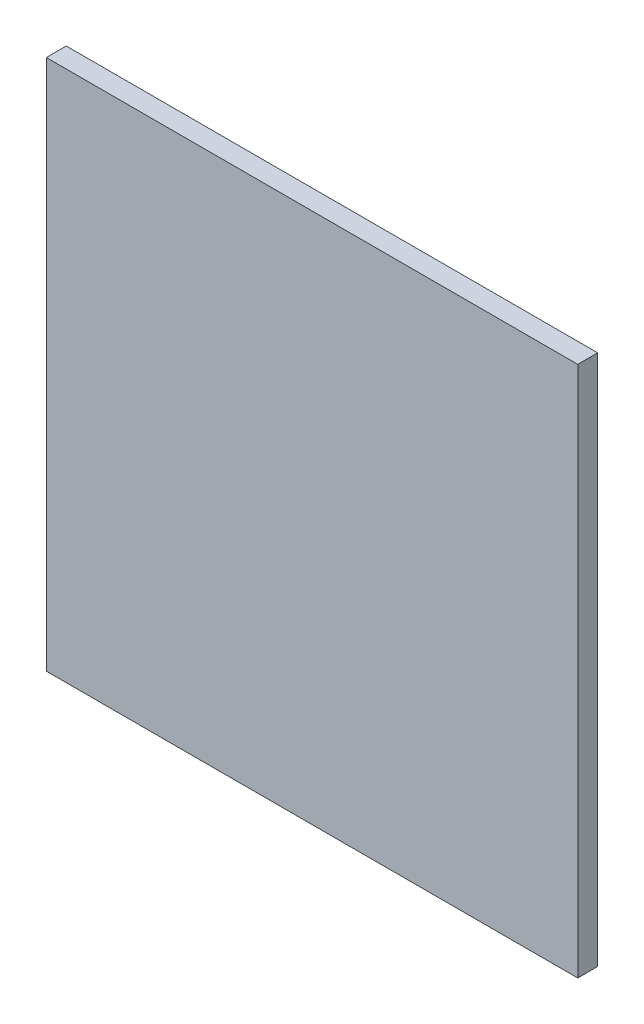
ISO-10303-21;
HEADER;
FILE_DESCRIPTION(('STEP AP214'),'2;1');
FILE_NAME('part.step','',(''),(''),'','','');
FILE_SCHEMA(('AUTOMOTIVE_DESIGN { 1 0 10303 214 1 1 1 1 }'));
ENDSEC;
DATA;
#1=APPLICATION_CONTEXT('core data for automotive mechanical design processes');
#2=APPLICATION_PROTOCOL_DEFINITION('international standard','automotive_design',2000,#1);
#3=PRODUCT_CONTEXT('',#1,'mechanical');
#4=PRODUCT('Part','Part','',(#3));
#5=PRODUCT_RELATED_PRODUCT_CATEGORY('part','',(#4));
#6=PRODUCT_DEFINITION_FORMATION('','',#4);
#7=PRODUCT_DEFINITION_CONTEXT('part definition',#1,'design');
#8=PRODUCT_DEFINITION('design','',#6,#7);
#9=PRODUCT_DEFINITION_SHAPE('','',#8);
#10=(LENGTH_UNIT() NAMED_UNIT(*) SI_UNIT(.MILLI.,.METRE.));
#11=(NAMED_UNIT(*) PLANE_ANGLE_UNIT() SI_UNIT($,.RADIAN.));
#12=(NAMED_UNIT(*) SI_UNIT($,.STERADIAN.) SOLID_ANGLE_UNIT());
#13=UNCERTAINTY_MEASURE_WITH_UNIT(LENGTH_MEASURE(1.E-05),#10,'distance_accuracy_value','');
#14=(GEOMETRIC_REPRESENTATION_CONTEXT(3) GLOBAL_UNCERTAINTY_ASSIGNED_CONTEXT((#13)) GLOBAL_UNIT_ASSIGNED_CONTEXT((#10,
#11,#12)) REPRESENTATION_CONTEXT('',''));
#15=CARTESIAN_POINT('',(0.,0.,0.));
#16=DIRECTION('',(0.,0.,1.));
#17=DIRECTION('',(1.,0.,0.));
#18=AXIS2_PLACEMENT_3D('',#15,#16,#17);
#19=CARTESIAN_POINT('',(200.,200.,15.));
#20=DIRECTION('',(-1.,0.,0.));
#21=DIRECTION('',(0.,-1.,0.));
#22=AXIS2_PLACEMENT_3D('',#19,#20,#21);
#23=PLANE('',#22);
#24=DIRECTION('',(0.,1.,0.));
#25=VECTOR('',#24,1.);
#26=CARTESIAN_POINT('',(200.,200.,0.));
#27=LINE('',#26,#25);
#28=CARTESIAN_POINT('',(200.,-200.,0.));
#29=VERTEX_POINT('',#28);
#30=CARTESIAN_POINT('',(200.,200.,0.));
#31=VERTEX_POINT('',#30);
#32=EDGE_CURVE('E111',#29,#31,#27,.T.);
#33=ORIENTED_EDGE('',*,*,#32,.T.);
#34=DIRECTION('',(0.,0.,-1.));
#35=VECTOR('',#34,1.);
#36=CARTESIAN_POINT('',(200.,200.,15.));
#37=LINE('',#36,#35);
#38=CARTESIAN_POINT('',(200.,200.,15.));
#39=VERTEX_POINT('',#38);
#40=EDGE_CURVE('E11',#39,#31,#37,.T.);
#41=ORIENTED_EDGE('',*,*,#40,.F.);
#42=DIRECTION('',(0.,1.,0.));
#43=VECTOR('',#42,1.);
#44=CARTESIAN_POINT('',(200.,200.,15.));
#45=LINE('',#44,#43);
#46=CARTESIAN_POINT('',(200.,-200.,15.));
#47=VERTEX_POINT('',#46);
#48=EDGE_CURVE('E95',#47,#39,#45,.T.);
#49=ORIENTED_EDGE('',*,*,#48,.F.);
#50=DIRECTION('',(0.,0.,-1.));
#51=VECTOR('',#50,1.);
#52=CARTESIAN_POINT('',(200.,-200.,15.));
#53=LINE('',#52,#51);
#54=EDGE_CURVE('E107',#47,#29,#53,.T.);
#55=ORIENTED_EDGE('',*,*,#54,.T.);
#56=EDGE_LOOP('',(#33,#41,#49,#55));
#57=FACE_BOUND('',#56,.T.);
#58=ADVANCED_FACE('F43',(#57),#23,.F.);
#59=CARTESIAN_POINT('',(-200.,200.,15.));
#60=DIRECTION('',(0.,-1.,0.));
#61=DIRECTION('',(0.,0.,-1.));
#62=AXIS2_PLACEMENT_3D('',#59,#60,#61);
#63=PLANE('',#62);
#64=DIRECTION('',(-1.,0.,0.));
#65=VECTOR('',#64,1.);
#66=CARTESIAN_POINT('',(-200.,200.,0.));
#67=LINE('',#66,#65);
#68=CARTESIAN_POINT('',(-200.,200.,0.));
#69=VERTEX_POINT('',#68);
#70=EDGE_CURVE('E100',#31,#69,#67,.T.);
#71=ORIENTED_EDGE('',*,*,#70,.T.);
#72=DIRECTION('',(0.,0.,-1.));
#73=VECTOR('',#72,1.);
#74=CARTESIAN_POINT('',(-200.,200.,15.));
#75=LINE('',#74,#73);
#76=CARTESIAN_POINT('',(-200.,200.,15.));
#77=VERTEX_POINT('',#76);
#78=EDGE_CURVE('E52',#77,#69,#75,.T.);
#79=ORIENTED_EDGE('',*,*,#78,.F.);
#80=DIRECTION('',(-1.,0.,0.));
#81=VECTOR('',#80,1.);
#82=CARTESIAN_POINT('',(-200.,200.,15.));
#83=LINE('',#82,#81);
#84=EDGE_CURVE('E90',#39,#77,#83,.T.);
#85=ORIENTED_EDGE('',*,*,#84,.F.);
#86=ORIENTED_EDGE('',*,*,#40,.T.);
#87=EDGE_LOOP('',(#71,#79,#85,#86));
#88=FACE_BOUND('',#87,.T.);
#89=ADVANCED_FACE('F99',(#88),#63,.F.);
#90=CARTESIAN_POINT('',(-200.,200.,15.));
#91=DIRECTION('',(1.,0.,0.));
#92=DIRECTION('',(0.,1.,0.));
#93=AXIS2_PLACEMENT_3D('',#90,#91,#92);
#94=PLANE('',#93);
#95=DIRECTION('',(0.,-1.,0.));
#96=VECTOR('',#95,1.);
#97=CARTESIAN_POINT('',(-200.,200.,0.));
#98=LINE('',#97,#96);
#99=CARTESIAN_POINT('',(-200.,-200.,0.));
#100=VERTEX_POINT('',#99);
#101=EDGE_CURVE('E77',#69,#100,#98,.T.);
#102=ORIENTED_EDGE('',*,*,#101,.T.);
#103=DIRECTION('',(0.,0.,-1.));
#104=VECTOR('',#103,1.);
#105=CARTESIAN_POINT('',(-200.,-200.,15.));
#106=LINE('',#105,#104);
#107=CARTESIAN_POINT('',(-200.,-200.,15.));
#108=VERTEX_POINT('',#107);
#109=EDGE_CURVE('E102',#108,#100,#106,.T.);
#110=ORIENTED_EDGE('',*,*,#109,.F.);
#111=DIRECTION('',(0.,-1.,0.));
#112=VECTOR('',#111,1.);
#113=CARTESIAN_POINT('',(-200.,200.,15.));
#114=LINE('',#113,#112);
#115=EDGE_CURVE('E93',#77,#108,#114,.T.);
#116=ORIENTED_EDGE('',*,*,#115,.F.);
#117=ORIENTED_EDGE('',*,*,#78,.T.);
#118=EDGE_LOOP('',(#102,#110,#116,#117));
#119=FACE_BOUND('',#118,.T.);
#120=ADVANCED_FACE('F103',(#119),#94,.F.);
#121=CARTESIAN_POINT('',(-200.,-200.,15.));
#122=DIRECTION('',(0.,1.,0.));
#123=DIRECTION('',(0.,0.,1.));
#124=AXIS2_PLACEMENT_3D('',#121,#122,#123);
#125=PLANE('',#124);
#126=DIRECTION('',(1.,0.,0.));
#127=VECTOR('',#126,1.);
#128=CARTESIAN_POINT('',(-200.,-200.,0.));
#129=LINE('',#128,#127);
#130=EDGE_CURVE('E83',#100,#29,#129,.T.);
#131=ORIENTED_EDGE('',*,*,#130,.T.);
#132=ORIENTED_EDGE('',*,*,#54,.F.);
#133=DIRECTION('',(1.,0.,0.));
#134=VECTOR('',#133,1.);
#135=CARTESIAN_POINT('',(-200.,-200.,15.));
#136=LINE('',#135,#134);
#137=EDGE_CURVE('E60',#108,#47,#136,.T.);
#138=ORIENTED_EDGE('',*,*,#137,.F.);
#139=ORIENTED_EDGE('',*,*,#109,.T.);
#140=EDGE_LOOP('',(#131,#132,#138,#139));
#141=FACE_BOUND('',#140,.T.);
#142=ADVANCED_FACE('F124',(#141),#125,.F.);
#143=CARTESIAN_POINT('',(0.,0.,15.));
#144=DIRECTION('',(0.,0.,1.));
#145=DIRECTION('',(1.,0.,0.));
#146=AXIS2_PLACEMENT_3D('',#143,#144,#145);
#147=PLANE('',#146);
#148=ORIENTED_EDGE('',*,*,#48,.T.);
#149=ORIENTED_EDGE('',*,*,#84,.T.);
#150=ORIENTED_EDGE('',*,*,#115,.T.);
#151=ORIENTED_EDGE('',*,*,#137,.T.);
#152=EDGE_LOOP('',(#148,#149,#150,#151));
#153=FACE_BOUND('',#152,.T.);
#154=ADVANCED_FACE('F91',(#153),#147,.T.);
#155=CARTESIAN_POINT('',(0.,0.,0.));
#156=DIRECTION('',(0.,0.,1.));
#157=DIRECTION('',(1.,0.,0.));
#158=AXIS2_PLACEMENT_3D('',#155,#156,#157);
#159=PLANE('',#158);
#160=ORIENTED_EDGE('',*,*,#32,.F.);
#161=ORIENTED_EDGE('',*,*,#130,.F.);
#162=ORIENTED_EDGE('',*,*,#101,.F.);
#163=ORIENTED_EDGE('',*,*,#70,.F.);
#164=EDGE_LOOP('',(#160,#161,#162,#163));
#165=FACE_BOUND('',#164,.T.);
#166=ADVANCED_FACE('F127',(#165),#159,.F.);
#167=CLOSED_SHELL('',(#58,#89,#120,#142,#154,#166));
#168=MANIFOLD_SOLID_BREP('B2',#167);
#169=ADVANCED_BREP_SHAPE_REPRESENTATION('',(#18,#168),#14);
#170=SHAPE_DEFINITION_REPRESENTATION(#9,#169);
ENDSEC;
END-ISO-10303-21;
